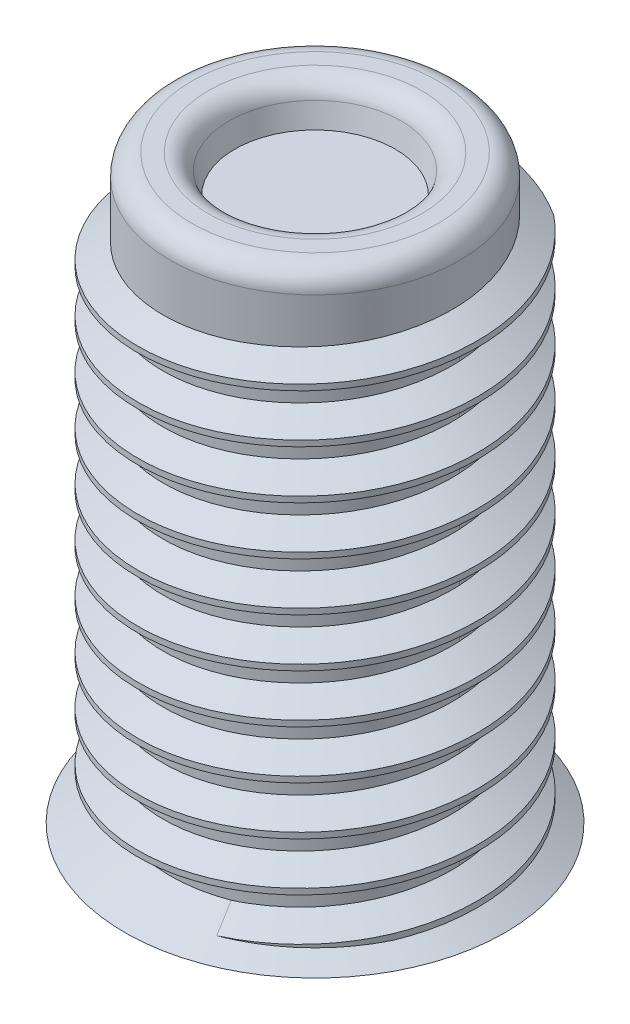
from build123d import *

# Parameters (mm, degrees)
SWEEP1_PITCH       = 0.907142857
SWEEP1_HEIGHT      = 9.978571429
SWEEP1_RADIUS      = 2.6797
SWEEP1_START_ANGLE = -180
SKETCH5_W          = 3.556
SKETCH5_H          = 0.791802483
CUT_EXTRUDE1_DEPTH = 1.778


with BuildPart() as part:
    # Sketch1 → Revolve1 (revolve)
    with BuildSketch(Plane.XY):
        with BuildLine():
            Line((0, 0), (3.556, 0))
            Line((3.556, 0), (2.7051, 0.491267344))
            Line((2.7051, 0.491267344), (2.7051, 7.493))
            Line((2.7051, 7.493), (2.7051, 10.46))
            ThreePointArc((2.7051, 10.46), (2.587942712, 10.742842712), (2.3051, 10.86))
            Line((2.3051, 10.86), (1.99449523, 10.86))
            ThreePointArc((1.99449523, 10.86), (1.750990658, 10.777341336), (1.608124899, 10.563527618))
            Line((1.608124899, 10.563527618), (1.5, 10.16))
            Line((1.5, 10.16), (0, 10.16))
            Line((0, 10.16), (0, 7.885188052))
            Line((0, 7.885188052), (0, 0))
        make_face()
    revolve(axis=Axis((0, 0, 0), (0, 1, 0)))

    # Sweep1: sweep along a helix
    with BuildLine() as sweep1_path:
        add(Helix(SWEEP1_PITCH, SWEEP1_HEIGHT, SWEEP1_RADIUS, center=(0, 0, 0), direction=(0, 1, 0), mode=Mode.PRIVATE).rotate(Axis((0, 0, 0), (0, 1, 0)), SWEEP1_START_ANGLE))
    # Sketch4 → Sweep1 (sweep)
    with BuildSketch(Plane(origin=(0, 0, 0), x_dir=(0, 0, -1), z_dir=(1, 0, 0))):
        Polygon((2.6797, 0), (3.175, -0.285961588), (3.175, -0.394395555), (2.6797, -0.680357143), align=None)
    sweep(path=sweep1_path.line, is_frenet=True)

    # Sketch5 → Cut-Revolve1 (revolve, cut)
    with BuildSketch(Plane.XY):
        with Locations((1.778, -0.395901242)):
            Rectangle(SKETCH5_W, SKETCH5_H)
    revolve(axis=Axis((0, 0, 0), (0, 1, 0)), mode=Mode.SUBTRACT)

    # Sketch6 → Cut-Extrude1 (cut)
    with BuildSketch(Plane(origin=(0, 10.86, 0), x_dir=(1, 0, 0), z_dir=(0, 1, 0))):
        with BuildLine():
            Line((0, 2.7051), (0, 3.253324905))
            ThreePointArc((0, 3.253324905), (1.626662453, 2.817462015), (2.817462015, 1.626662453))
            ThreePointArc((2.817462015, 1.626662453), (1.599968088, 2.665495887), (0, 2.7051))
        make_face()
    extrude(amount=-CUT_EXTRUDE1_DEPTH, mode=Mode.SUBTRACT)


solid = part.part
